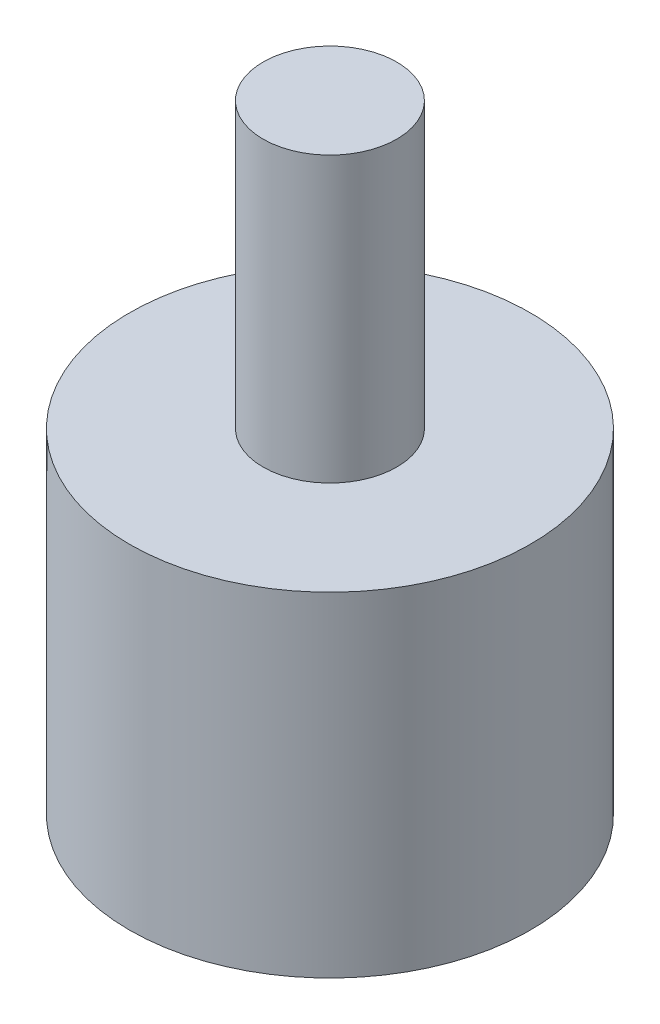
ISO-10303-21;
HEADER;
FILE_DESCRIPTION(('STEP AP214'),'2;1');
FILE_NAME('part.step','',(''),(''),'','','');
FILE_SCHEMA(('AUTOMOTIVE_DESIGN { 1 0 10303 214 1 1 1 1 }'));
ENDSEC;
DATA;
#1=APPLICATION_CONTEXT('core data for automotive mechanical design processes');
#2=APPLICATION_PROTOCOL_DEFINITION('international standard','automotive_design',2000,#1);
#3=PRODUCT_CONTEXT('',#1,'mechanical');
#4=PRODUCT('Part','Part','',(#3));
#5=PRODUCT_RELATED_PRODUCT_CATEGORY('part','',(#4));
#6=PRODUCT_DEFINITION_FORMATION('','',#4);
#7=PRODUCT_DEFINITION_CONTEXT('part definition',#1,'design');
#8=PRODUCT_DEFINITION('design','',#6,#7);
#9=PRODUCT_DEFINITION_SHAPE('','',#8);
#10=(LENGTH_UNIT() NAMED_UNIT(*) SI_UNIT(.MILLI.,.METRE.));
#11=(NAMED_UNIT(*) PLANE_ANGLE_UNIT() SI_UNIT($,.RADIAN.));
#12=(NAMED_UNIT(*) SI_UNIT($,.STERADIAN.) SOLID_ANGLE_UNIT());
#13=UNCERTAINTY_MEASURE_WITH_UNIT(LENGTH_MEASURE(1.E-05),#10,'distance_accuracy_value','');
#14=(GEOMETRIC_REPRESENTATION_CONTEXT(3) GLOBAL_UNCERTAINTY_ASSIGNED_CONTEXT((#13)) GLOBAL_UNIT_ASSIGNED_CONTEXT((#10,
#11,#12)) REPRESENTATION_CONTEXT('',''));
#15=CARTESIAN_POINT('',(0.,0.,0.));
#16=DIRECTION('',(0.,0.,1.));
#17=DIRECTION('',(1.,0.,0.));
#18=AXIS2_PLACEMENT_3D('',#15,#16,#17);
#19=CARTESIAN_POINT('',(0.,20.,0.));
#20=DIRECTION('',(0.,-1.,0.));
#21=DIRECTION('',(0.,0.,-1.));
#22=AXIS2_PLACEMENT_3D('',#19,#20,#21);
#23=CYLINDRICAL_SURFACE('',#22,12.);
#24=CARTESIAN_POINT('',(0.,20.,0.));
#25=DIRECTION('',(0.,1.,0.));
#26=DIRECTION('',(0.,0.,1.));
#27=AXIS2_PLACEMENT_3D('',#24,#25,#26);
#28=CIRCLE('',#27,12.);
#29=CARTESIAN_POINT('',(0.,20.,12.));
#30=VERTEX_POINT('',#29);
#31=EDGE_CURVE('E38',#30,#30,#28,.T.);
#32=ORIENTED_EDGE('',*,*,#31,.F.);
#33=EDGE_LOOP('',(#32));
#34=FACE_BOUND('',#33,.T.);
#35=CARTESIAN_POINT('',(0.,0.,0.));
#36=DIRECTION('',(0.,1.,0.));
#37=DIRECTION('',(0.,0.,1.));
#38=AXIS2_PLACEMENT_3D('',#35,#36,#37);
#39=CIRCLE('',#38,12.);
#40=CARTESIAN_POINT('',(0.,0.,12.));
#41=VERTEX_POINT('',#40);
#42=EDGE_CURVE('E34',#41,#41,#39,.T.);
#43=ORIENTED_EDGE('',*,*,#42,.T.);
#44=EDGE_LOOP('',(#43));
#45=FACE_BOUND('',#44,.T.);
#46=ADVANCED_FACE('F31',(#34,#45),#23,.T.);
#47=CARTESIAN_POINT('',(0.,20.,0.));
#48=DIRECTION('',(0.,1.,0.));
#49=DIRECTION('',(0.,0.,1.));
#50=AXIS2_PLACEMENT_3D('',#47,#48,#49);
#51=PLANE('',#50);
#52=CARTESIAN_POINT('',(0.,20.,0.));
#53=DIRECTION('',(0.,1.,0.));
#54=DIRECTION('',(0.,0.,1.));
#55=AXIS2_PLACEMENT_3D('',#52,#53,#54);
#56=CIRCLE('',#55,4.);
#57=CARTESIAN_POINT('',(0.,20.,4.));
#58=VERTEX_POINT('',#57);
#59=EDGE_CURVE('E10',#58,#58,#56,.T.);
#60=ORIENTED_EDGE('',*,*,#59,.F.);
#61=EDGE_LOOP('',(#60));
#62=FACE_BOUND('',#61,.T.);
#63=ORIENTED_EDGE('',*,*,#31,.T.);
#64=EDGE_LOOP('',(#63));
#65=FACE_BOUND('',#64,.T.);
#66=ADVANCED_FACE('F55',(#62,#65),#51,.T.);
#67=CARTESIAN_POINT('',(0.,0.,0.));
#68=DIRECTION('',(0.,1.,0.));
#69=DIRECTION('',(0.,0.,1.));
#70=AXIS2_PLACEMENT_3D('',#67,#68,#69);
#71=PLANE('',#70);
#72=ORIENTED_EDGE('',*,*,#42,.F.);
#73=EDGE_LOOP('',(#72));
#74=FACE_BOUND('',#73,.T.);
#75=ADVANCED_FACE('F52',(#74),#71,.F.);
#76=CARTESIAN_POINT('',(0.,37.,0.));
#77=DIRECTION('',(0.,-1.,0.));
#78=DIRECTION('',(0.,0.,-1.));
#79=AXIS2_PLACEMENT_3D('',#76,#77,#78);
#80=CYLINDRICAL_SURFACE('',#79,4.);
#81=CARTESIAN_POINT('',(0.,37.,0.));
#82=DIRECTION('',(0.,1.,0.));
#83=DIRECTION('',(0.,0.,1.));
#84=AXIS2_PLACEMENT_3D('',#81,#82,#83);
#85=CIRCLE('',#84,4.);
#86=CARTESIAN_POINT('',(0.,37.,4.));
#87=VERTEX_POINT('',#86);
#88=EDGE_CURVE('E44',#87,#87,#85,.T.);
#89=ORIENTED_EDGE('',*,*,#88,.F.);
#90=EDGE_LOOP('',(#89));
#91=FACE_BOUND('',#90,.T.);
#92=ORIENTED_EDGE('',*,*,#59,.T.);
#93=EDGE_LOOP('',(#92));
#94=FACE_BOUND('',#93,.T.);
#95=ADVANCED_FACE('F54',(#91,#94),#80,.T.);
#96=CARTESIAN_POINT('',(0.,37.,0.));
#97=DIRECTION('',(0.,1.,0.));
#98=DIRECTION('',(0.,0.,1.));
#99=AXIS2_PLACEMENT_3D('',#96,#97,#98);
#100=PLANE('',#99);
#101=ORIENTED_EDGE('',*,*,#88,.T.);
#102=EDGE_LOOP('',(#101));
#103=FACE_BOUND('',#102,.T.);
#104=ADVANCED_FACE('F60',(#103),#100,.T.);
#105=CLOSED_SHELL('',(#46,#66,#75,#95,#104));
#106=MANIFOLD_SOLID_BREP('B2',#105);
#107=ADVANCED_BREP_SHAPE_REPRESENTATION('',(#18,#106),#14);
#108=SHAPE_DEFINITION_REPRESENTATION(#9,#107);
ENDSEC;
END-ISO-10303-21;
